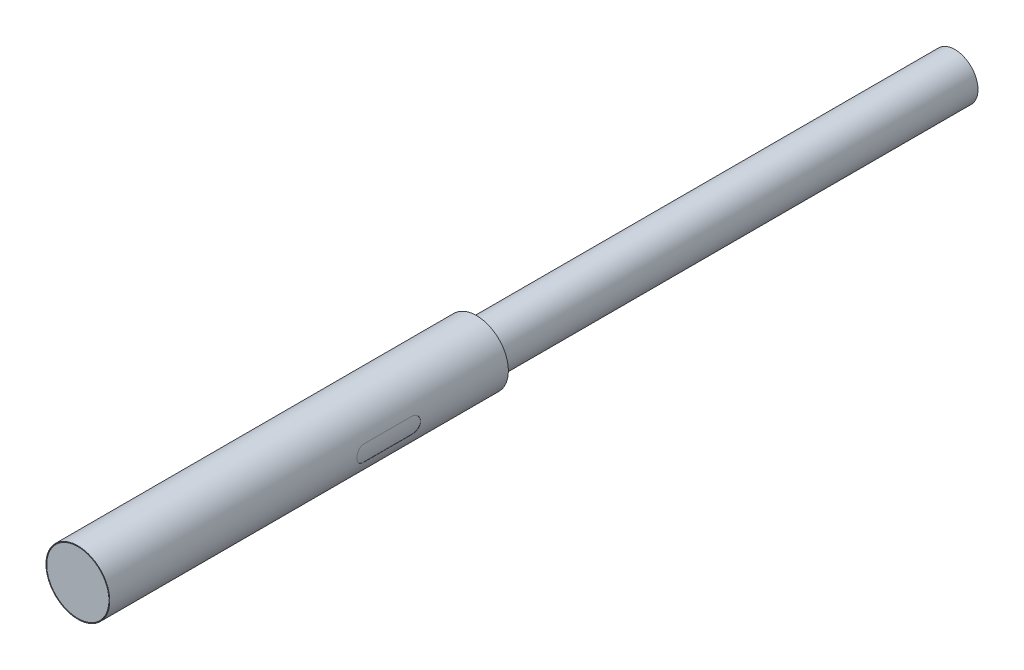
ISO-10303-21;
HEADER;
FILE_DESCRIPTION(('STEP AP214'),'2;1');
FILE_NAME('part.step','',(''),(''),'','','');
FILE_SCHEMA(('AUTOMOTIVE_DESIGN { 1 0 10303 214 1 1 1 1 }'));
ENDSEC;
DATA;
#1=APPLICATION_CONTEXT('core data for automotive mechanical design processes');
#2=APPLICATION_PROTOCOL_DEFINITION('international standard','automotive_design',2000,#1);
#3=PRODUCT_CONTEXT('',#1,'mechanical');
#4=PRODUCT('Part','Part','',(#3));
#5=PRODUCT_RELATED_PRODUCT_CATEGORY('part','',(#4));
#6=PRODUCT_DEFINITION_FORMATION('','',#4);
#7=PRODUCT_DEFINITION_CONTEXT('part definition',#1,'design');
#8=PRODUCT_DEFINITION('design','',#6,#7);
#9=PRODUCT_DEFINITION_SHAPE('','',#8);
#10=(LENGTH_UNIT() NAMED_UNIT(*) SI_UNIT(.MILLI.,.METRE.));
#11=(NAMED_UNIT(*) PLANE_ANGLE_UNIT() SI_UNIT($,.RADIAN.));
#12=(NAMED_UNIT(*) SI_UNIT($,.STERADIAN.) SOLID_ANGLE_UNIT());
#13=UNCERTAINTY_MEASURE_WITH_UNIT(LENGTH_MEASURE(1.E-05),#10,'distance_accuracy_value','');
#14=(GEOMETRIC_REPRESENTATION_CONTEXT(3) GLOBAL_UNCERTAINTY_ASSIGNED_CONTEXT((#13)) GLOBAL_UNIT_ASSIGNED_CONTEXT((#10,
#11,#12)) REPRESENTATION_CONTEXT('',''));
#15=CARTESIAN_POINT('',(0.,0.,0.));
#16=DIRECTION('',(0.,0.,1.));
#17=DIRECTION('',(1.,0.,0.));
#18=AXIS2_PLACEMENT_3D('',#15,#16,#17);
#19=CARTESIAN_POINT('',(0.,0.,-25.));
#20=DIRECTION('',(0.,0.,1.));
#21=DIRECTION('',(1.,0.,0.));
#22=AXIS2_PLACEMENT_3D('',#19,#20,#21);
#23=CYLINDRICAL_SURFACE('',#22,2.);
#24=CARTESIAN_POINT('',(1.93782484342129,-0.494807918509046,-19.));
#25=CARTESIAN_POINT('',(1.93801507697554,-0.494062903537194,-19.1331739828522));
#26=CARTESIAN_POINT('',(1.952351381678,-0.443966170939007,-19.2598228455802));
#27=CARTESIAN_POINT('',(1.97707122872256,-0.305589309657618,-19.4004185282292));
#28=CARTESIAN_POINT('',(1.98500413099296,-0.252009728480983,-19.4365662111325));
#29=CARTESIAN_POINT('',(1.99670398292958,-0.130090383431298,-19.4873132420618));
#30=CARTESIAN_POINT('',(2.,-0.0662868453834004,-19.4999999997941));
#31=CARTESIAN_POINT('',(2.,0.0662868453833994,-19.4999999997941));
#32=CARTESIAN_POINT('',(1.99670293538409,0.130101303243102,-19.4872943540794));
#33=CARTESIAN_POINT('',(1.98500517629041,0.251998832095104,-19.436585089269));
#34=CARTESIAN_POINT('',(1.9770728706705,0.30558011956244,-19.4004091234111));
#35=CARTESIAN_POINT('',(1.96058968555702,0.397849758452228,-19.3066974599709));
#36=CARTESIAN_POINT('',(1.95268375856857,0.433205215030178,-19.252429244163));
#37=CARTESIAN_POINT('',(1.94109552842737,0.482481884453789,-19.1302540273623));
#38=CARTESIAN_POINT('',(1.93784043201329,0.494746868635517,-19.0664734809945));
#39=CARTESIAN_POINT('',(1.93782484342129,0.494807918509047,-19.));
#40=B_SPLINE_CURVE_WITH_KNOTS('',3,(#24,#25,#26,#27,#28,#29,#30,#31,#32,#33,#34,#35,#36,#37,#38,
#39),.UNSPECIFIED.,.F.,.F.,(4,2,2,2,2,2,2,4),(0.,0.25,0.375,0.5,0.625,0.75,0.875,1.),.UNSPECIFIED.);
#41=CARTESIAN_POINT('',(1.93782484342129,-0.494807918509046,-19.));
#42=VERTEX_POINT('',#41);
#43=CARTESIAN_POINT('',(1.93782484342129,0.494807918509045,-19.));
#44=VERTEX_POINT('',#43);
#45=EDGE_CURVE('E122',#42,#44,#40,.T.);
#46=ORIENTED_EDGE('',*,*,#45,.F.);
#47=DIRECTION('',(0.,0.,-1.));
#48=VECTOR('',#47,1.);
#49=CARTESIAN_POINT('',(1.93782484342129,-0.494807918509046,-16.));
#50=LINE('',#49,#48);
#51=CARTESIAN_POINT('',(1.93782484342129,-0.494807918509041,-16.));
#52=VERTEX_POINT('',#51);
#53=EDGE_CURVE('E128',#52,#42,#50,.T.);
#54=ORIENTED_EDGE('',*,*,#53,.F.);
#55=CARTESIAN_POINT('',(1.93782484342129,0.494807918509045,-16.));
#56=CARTESIAN_POINT('',(1.93801507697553,0.494062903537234,-15.8668260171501));
#57=CARTESIAN_POINT('',(1.95235138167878,0.443966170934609,-15.740177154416));
#58=CARTESIAN_POINT('',(1.97707122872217,0.305589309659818,-15.5995814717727));
#59=CARTESIAN_POINT('',(1.98500413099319,0.252009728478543,-15.5634337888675));
#60=CARTESIAN_POINT('',(1.99670398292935,0.13009038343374,-15.5126867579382));
#61=CARTESIAN_POINT('',(2.,0.0662868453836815,-15.5000000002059));
#62=CARTESIAN_POINT('',(2.,-0.0662868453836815,-15.5000000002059));
#63=CARTESIAN_POINT('',(1.99670293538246,-0.130101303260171,-15.5127056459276));
#64=CARTESIAN_POINT('',(1.98500517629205,-0.251998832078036,-15.563414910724));
#65=CARTESIAN_POINT('',(1.97707287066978,-0.305580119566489,-15.5995908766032));
#66=CARTESIAN_POINT('',(1.96058968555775,-0.39784975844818,-15.6933025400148));
#67=CARTESIAN_POINT('',(1.95268375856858,-0.433205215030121,-15.7475707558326));
#68=CARTESIAN_POINT('',(1.94109552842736,-0.48248188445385,-15.8697459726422));
#69=CARTESIAN_POINT('',(1.93784043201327,-0.494746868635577,-15.93352651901));
#70=CARTESIAN_POINT('',(1.93782484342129,-0.494807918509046,-16.));
#71=B_SPLINE_CURVE_WITH_KNOTS('',3,(#55,#56,#57,#58,#59,#60,#61,#62,#63,#64,#65,#66,#67,#68,#69,
#70),.UNSPECIFIED.,.F.,.F.,(4,2,2,2,2,2,2,4),(0.,0.25,0.375,0.5,0.625,0.75,0.875,1.),.UNSPECIFIED.);
#72=CARTESIAN_POINT('',(1.93782484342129,0.494807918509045,-16.));
#73=VERTEX_POINT('',#72);
#74=EDGE_CURVE('E76',#73,#52,#71,.T.);
#75=ORIENTED_EDGE('',*,*,#74,.F.);
#76=DIRECTION('',(0.,0.,1.));
#77=VECTOR('',#76,1.);
#78=CARTESIAN_POINT('',(1.93782484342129,0.494807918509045,-19.));
#79=LINE('',#78,#77);
#80=EDGE_CURVE('E113',#44,#73,#79,.T.);
#81=ORIENTED_EDGE('',*,*,#80,.F.);
#82=EDGE_LOOP('',(#46,#54,#75,#81));
#83=FACE_BOUND('',#82,.T.);
#84=CARTESIAN_POINT('',(0.,0.,-25.));
#85=DIRECTION('',(0.,0.,1.));
#86=DIRECTION('',(1.,0.,0.));
#87=AXIS2_PLACEMENT_3D('',#84,#85,#86);
#88=CIRCLE('',#87,2.);
#89=CARTESIAN_POINT('',(2.,0.,-25.));
#90=VERTEX_POINT('',#89);
#91=EDGE_CURVE('E68',#90,#90,#88,.T.);
#92=ORIENTED_EDGE('',*,*,#91,.T.);
#93=EDGE_LOOP('',(#92));
#94=FACE_BOUND('',#93,.T.);
#95=CARTESIAN_POINT('',(0.,0.,0.));
#96=DIRECTION('',(0.,0.,1.));
#97=DIRECTION('',(1.,0.,0.));
#98=AXIS2_PLACEMENT_3D('',#95,#96,#97);
#99=CIRCLE('',#98,2.);
#100=CARTESIAN_POINT('',(2.,0.,0.));
#101=VERTEX_POINT('',#100);
#102=EDGE_CURVE('E337',#101,#101,#99,.T.);
#103=ORIENTED_EDGE('',*,*,#102,.F.);
#104=EDGE_LOOP('',(#103));
#105=FACE_BOUND('',#104,.T.);
#106=ADVANCED_FACE('F58',(#83,#94,#105),#23,.T.);
#107=CARTESIAN_POINT('',(0.,0.,-25.));
#108=DIRECTION('',(0.,0.,1.));
#109=DIRECTION('',(1.,0.,0.));
#110=AXIS2_PLACEMENT_3D('',#107,#108,#109);
#111=PLANE('',#110);
#112=CARTESIAN_POINT('',(0.,0.,-25.));
#113=DIRECTION('',(0.,0.,1.));
#114=DIRECTION('',(1.,0.,0.));
#115=AXIS2_PLACEMENT_3D('',#112,#113,#114);
#116=CIRCLE('',#115,1.45);
#117=CARTESIAN_POINT('',(1.45,0.,-25.));
#118=VERTEX_POINT('',#117);
#119=EDGE_CURVE('E13',#118,#118,#116,.F.);
#120=ORIENTED_EDGE('',*,*,#119,.F.);
#121=EDGE_LOOP('',(#120));
#122=FACE_BOUND('',#121,.T.);
#123=ORIENTED_EDGE('',*,*,#91,.F.);
#124=EDGE_LOOP('',(#123));
#125=FACE_BOUND('',#124,.T.);
#126=ADVANCED_FACE('F286',(#122,#125),#111,.F.);
#127=CARTESIAN_POINT('',(0.,0.,0.));
#128=DIRECTION('',(0.,0.,1.));
#129=DIRECTION('',(1.,0.,0.));
#130=AXIS2_PLACEMENT_3D('',#127,#128,#129);
#131=PLANE('',#130);
#132=CARTESIAN_POINT('',(0.,0.,0.));
#133=DIRECTION('',(0.,0.,1.));
#134=DIRECTION('',(1.,0.,0.));
#135=AXIS2_PLACEMENT_3D('',#132,#133,#134);
#136=CIRCLE('',#135,1.975);
#137=CARTESIAN_POINT('',(1.975,0.,0.));
#138=VERTEX_POINT('',#137);
#139=EDGE_CURVE('E332',#138,#138,#136,.T.);
#140=ORIENTED_EDGE('',*,*,#139,.F.);
#141=EDGE_LOOP('',(#140));
#142=FACE_BOUND('',#141,.T.);
#143=ORIENTED_EDGE('',*,*,#102,.T.);
#144=EDGE_LOOP('',(#143));
#145=FACE_BOUND('',#144,.T.);
#146=ADVANCED_FACE('F290',(#142,#145),#131,.T.);
#147=CARTESIAN_POINT('',(0.,0.,-0.1));
#148=DIRECTION('',(0.,0.,1.));
#149=DIRECTION('',(1.,0.,0.));
#150=AXIS2_PLACEMENT_3D('',#147,#148,#149);
#151=CYLINDRICAL_SURFACE('',#150,1.975);
#152=CARTESIAN_POINT('',(0.,0.,-0.1));
#153=DIRECTION('',(0.,0.,1.));
#154=DIRECTION('',(1.,0.,0.));
#155=AXIS2_PLACEMENT_3D('',#152,#153,#154);
#156=CIRCLE('',#155,1.975);
#157=CARTESIAN_POINT('',(1.975,0.,-0.1));
#158=VERTEX_POINT('',#157);
#159=EDGE_CURVE('E334',#158,#158,#156,.T.);
#160=ORIENTED_EDGE('',*,*,#159,.F.);
#161=EDGE_LOOP('',(#160));
#162=FACE_BOUND('',#161,.T.);
#163=ORIENTED_EDGE('',*,*,#139,.T.);
#164=EDGE_LOOP('',(#163));
#165=FACE_BOUND('',#164,.T.);
#166=ADVANCED_FACE('F296',(#162,#165),#151,.F.);
#167=CARTESIAN_POINT('',(0.,0.,-0.1));
#168=DIRECTION('',(0.,0.,1.));
#169=DIRECTION('',(1.,0.,0.));
#170=AXIS2_PLACEMENT_3D('',#167,#168,#169);
#171=PLANE('',#170);
#172=CARTESIAN_POINT('',(0.,0.,-0.1));
#173=DIRECTION('',(0.,0.,1.));
#174=DIRECTION('',(1.,0.,0.));
#175=AXIS2_PLACEMENT_3D('',#172,#173,#174);
#176=CIRCLE('',#175,1.95);
#177=CARTESIAN_POINT('',(1.95,0.,-0.1));
#178=VERTEX_POINT('',#177);
#179=EDGE_CURVE('E325',#178,#178,#176,.T.);
#180=ORIENTED_EDGE('',*,*,#179,.F.);
#181=EDGE_LOOP('',(#180));
#182=FACE_BOUND('',#181,.T.);
#183=ORIENTED_EDGE('',*,*,#159,.T.);
#184=EDGE_LOOP('',(#183));
#185=FACE_BOUND('',#184,.T.);
#186=ADVANCED_FACE('F304',(#182,#185),#171,.T.);
#187=CARTESIAN_POINT('',(0.,0.,-0.1));
#188=DIRECTION('',(0.,0.,1.));
#189=DIRECTION('',(1.,0.,0.));
#190=AXIS2_PLACEMENT_3D('',#187,#188,#189);
#191=CYLINDRICAL_SURFACE('',#190,1.95);
#192=ORIENTED_EDGE('',*,*,#179,.T.);
#193=EDGE_LOOP('',(#192));
#194=FACE_BOUND('',#193,.T.);
#195=CARTESIAN_POINT('',(0.,0.,0.));
#196=DIRECTION('',(0.,0.,1.));
#197=DIRECTION('',(1.,0.,0.));
#198=AXIS2_PLACEMENT_3D('',#195,#196,#197);
#199=CIRCLE('',#198,1.95);
#200=CARTESIAN_POINT('',(1.95,0.,0.));
#201=VERTEX_POINT('',#200);
#202=EDGE_CURVE('E322',#201,#201,#199,.T.);
#203=ORIENTED_EDGE('',*,*,#202,.F.);
#204=EDGE_LOOP('',(#203));
#205=FACE_BOUND('',#204,.T.);
#206=ADVANCED_FACE('F308',(#194,#205),#191,.T.);
#207=ORIENTED_EDGE('',*,*,#202,.T.);
#208=EDGE_LOOP('',(#207));
#209=FACE_BOUND('',#208,.T.);
#210=ADVANCED_FACE('F298',(#209),#131,.T.);
#211=CARTESIAN_POINT('',(0.,0.,-55.));
#212=DIRECTION('',(0.,0.,1.));
#213=DIRECTION('',(1.,0.,0.));
#214=AXIS2_PLACEMENT_3D('',#211,#212,#213);
#215=CYLINDRICAL_SURFACE('',#214,1.45);
#216=CARTESIAN_POINT('',(0.,0.,-55.));
#217=DIRECTION('',(0.,0.,-1.));
#218=DIRECTION('',(-1.,0.,0.));
#219=AXIS2_PLACEMENT_3D('',#216,#217,#218);
#220=CIRCLE('',#219,1.45);
#221=CARTESIAN_POINT('',(-1.45,0.,-55.));
#222=VERTEX_POINT('',#221);
#223=EDGE_CURVE('E223',#222,#222,#220,.T.);
#224=ORIENTED_EDGE('',*,*,#223,.F.);
#225=EDGE_LOOP('',(#224));
#226=FACE_BOUND('',#225,.T.);
#227=ORIENTED_EDGE('',*,*,#119,.T.);
#228=EDGE_LOOP('',(#227));
#229=FACE_BOUND('',#228,.T.);
#230=ADVANCED_FACE('F313',(#226,#229),#215,.T.);
#231=CARTESIAN_POINT('',(0.,0.,-55.));
#232=DIRECTION('',(0.,0.,-1.));
#233=DIRECTION('',(-1.,0.,0.));
#234=AXIS2_PLACEMENT_3D('',#231,#232,#233);
#235=PLANE('',#234);
#236=ORIENTED_EDGE('',*,*,#223,.T.);
#237=EDGE_LOOP('',(#236));
#238=FACE_BOUND('',#237,.T.);
#239=ADVANCED_FACE('F244',(#238),#235,.T.);
#240=CARTESIAN_POINT('',(1.93782484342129,-0.494807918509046,-19.));
#241=CARTESIAN_POINT('',(1.93801507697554,-0.494062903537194,-19.1331739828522));
#242=CARTESIAN_POINT('',(1.952351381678,-0.443966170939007,-19.2598228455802));
#243=CARTESIAN_POINT('',(1.97707122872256,-0.305589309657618,-19.4004185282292));
#244=CARTESIAN_POINT('',(1.98500413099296,-0.252009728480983,-19.4365662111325));
#245=CARTESIAN_POINT('',(1.99670398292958,-0.130090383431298,-19.4873132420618));
#246=CARTESIAN_POINT('',(2.,-0.0662868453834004,-19.4999999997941));
#247=CARTESIAN_POINT('',(2.,0.0662868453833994,-19.4999999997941));
#248=CARTESIAN_POINT('',(1.99670293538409,0.130101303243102,-19.4872943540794));
#249=CARTESIAN_POINT('',(1.98500517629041,0.251998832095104,-19.436585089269));
#250=CARTESIAN_POINT('',(1.9770728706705,0.30558011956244,-19.4004091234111));
#251=CARTESIAN_POINT('',(1.96058968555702,0.397849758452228,-19.3066974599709));
#252=CARTESIAN_POINT('',(1.95268375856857,0.433205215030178,-19.252429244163));
#253=CARTESIAN_POINT('',(1.94109552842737,0.482481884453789,-19.1302540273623));
#254=CARTESIAN_POINT('',(1.93784043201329,0.494746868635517,-19.0664734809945));
#255=CARTESIAN_POINT('',(1.93782484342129,0.494807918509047,-19.));
#256=CARTESIAN_POINT('',(1.92813571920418,-0.492333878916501,-19.));
#257=CARTESIAN_POINT('',(1.92832500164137,-0.491592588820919,-19.1331740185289));
#258=CARTESIAN_POINT('',(1.94258962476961,-0.441746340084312,-19.2598228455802));
#259=CARTESIAN_POINT('',(1.96718587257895,-0.30406136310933,-19.4004185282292));
#260=CARTESIAN_POINT('',(1.97507911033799,-0.250749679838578,-19.4365662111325));
#261=CARTESIAN_POINT('',(1.98672046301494,-0.129439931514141,-19.4873132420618));
#262=CARTESIAN_POINT('',(1.99,-0.0659554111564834,-19.4999999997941));
#263=CARTESIAN_POINT('',(1.99,0.0659554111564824,-19.4999999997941));
#264=CARTESIAN_POINT('',(1.98671942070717,0.129450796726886,-19.4872943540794));
#265=CARTESIAN_POINT('',(1.97508015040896,0.250738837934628,-19.436585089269));
#266=CARTESIAN_POINT('',(1.96718750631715,0.304052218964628,-19.4004091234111));
#267=CARTESIAN_POINT('',(1.95078673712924,0.395860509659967,-19.3066974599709));
#268=CARTESIAN_POINT('',(1.94292033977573,0.431039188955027,-19.252429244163));
#269=CARTESIAN_POINT('',(1.93139005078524,0.48006947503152,-19.1302540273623));
#270=CARTESIAN_POINT('',(1.92815122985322,0.492273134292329,-19.0664734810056));
#271=CARTESIAN_POINT('',(1.92813571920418,0.492333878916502,-19.));
#272=B_SPLINE_SURFACE_WITH_KNOTS('',1,3,((#240,#241,#242,#243,#244,#245,#246,#247,#248,#249,
#250,#251,#252,#253,#254,#255),(#256,#257,#258,#259,#260,#261,#262,#263,#264,#265,#266,#267,
#268,#269,#270,#271)),.UNSPECIFIED.,.F.,.F.,.F.,(2,2),(4,2,2,2,2,2,2,4),(0.,1.),(0.,0.25,0.375,
0.5,0.625,0.75,0.875,1.),.UNSPECIFIED.);
#273=CARTESIAN_POINT('',(1.92813571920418,-0.492333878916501,-19.));
#274=CARTESIAN_POINT('',(1.93782484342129,-0.494807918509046,-19.));
#275=B_SPLINE_CURVE_WITH_KNOTS('',1,(#273,#274),.UNSPECIFIED.,.F.,.F.,(2,2),(0.,1.),.UNSPECIFIED.);
#276=CARTESIAN_POINT('',(1.92813571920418,-0.492333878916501,-19.));
#277=VERTEX_POINT('',#276);
#278=EDGE_CURVE('E86',#277,#42,#275,.T.);
#279=CARTESIAN_POINT('',(1.93782484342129,0.494807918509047,-19.));
#280=CARTESIAN_POINT('',(1.92813571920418,0.492333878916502,-19.));
#281=B_SPLINE_CURVE_WITH_KNOTS('',1,(#279,#280),.UNSPECIFIED.,.F.,.F.,(2,2),(0.,1.),.UNSPECIFIED.);
#282=CARTESIAN_POINT('',(1.92813571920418,0.4923338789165,-19.));
#283=VERTEX_POINT('',#282);
#284=EDGE_CURVE('E109',#283,#44,#281,.F.);
#285=CARTESIAN_POINT('',(1.92813571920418,0.492333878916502,-19.));
#286=CARTESIAN_POINT('',(1.92815122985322,0.492273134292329,-19.0664734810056));
#287=CARTESIAN_POINT('',(1.93139005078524,0.48006947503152,-19.1302540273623));
#288=CARTESIAN_POINT('',(1.94292033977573,0.431039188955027,-19.252429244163));
#289=CARTESIAN_POINT('',(1.95078673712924,0.395860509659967,-19.3066974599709));
#290=CARTESIAN_POINT('',(1.96718750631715,0.304052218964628,-19.4004091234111));
#291=CARTESIAN_POINT('',(1.97508015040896,0.250738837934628,-19.436585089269));
#292=CARTESIAN_POINT('',(1.98671942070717,0.129450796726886,-19.4872943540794));
#293=CARTESIAN_POINT('',(1.99,0.0659554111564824,-19.4999999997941));
#294=CARTESIAN_POINT('',(1.99,-0.0659554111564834,-19.4999999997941));
#295=CARTESIAN_POINT('',(1.98672046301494,-0.129439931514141,-19.4873132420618));
#296=CARTESIAN_POINT('',(1.97507911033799,-0.250749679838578,-19.4365662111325));
#297=CARTESIAN_POINT('',(1.96718587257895,-0.30406136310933,-19.4004185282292));
#298=CARTESIAN_POINT('',(1.94258962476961,-0.441746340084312,-19.2598228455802));
#299=CARTESIAN_POINT('',(1.92832500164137,-0.491592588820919,-19.1331740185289));
#300=CARTESIAN_POINT('',(1.92813571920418,-0.492333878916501,-19.));
#301=B_SPLINE_CURVE_WITH_KNOTS('',3,(#285,#286,#287,#288,#289,#290,#291,#292,#293,#294,#295,
#296,#297,#298,#299,#300),.UNSPECIFIED.,.F.,.F.,(4,2,2,2,2,2,2,4),(0.,0.125,0.25,0.375,0.5,
0.625,0.75,1.),.UNSPECIFIED.);
#302=EDGE_CURVE('E179',#277,#283,#301,.F.);
#303=ORIENTED_EDGE('',*,*,#278,.T.);
#304=ORIENTED_EDGE('',*,*,#45,.T.);
#305=ORIENTED_EDGE('',*,*,#284,.F.);
#306=ORIENTED_EDGE('',*,*,#302,.F.);
#307=EDGE_LOOP('',(#303,#304,#305,#306));
#308=FACE_BOUND('',#307,.T.);
#309=ADVANCED_FACE('F124',(#308),#272,.F.);
#310=CARTESIAN_POINT('',(1.93782484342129,0.494807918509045,-17.5));
#311=DIRECTION('',(-0.247403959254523,0.968912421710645,0.));
#312=DIRECTION('',(0.,0.,1.));
#313=AXIS2_PLACEMENT_3D('',#310,#311,#312);
#314=PLANE('',#313);
#315=ORIENTED_EDGE('',*,*,#284,.T.);
#316=ORIENTED_EDGE('',*,*,#80,.T.);
#317=CARTESIAN_POINT('',(1.92813571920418,0.4923338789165,-16.));
#318=CARTESIAN_POINT('',(1.93782484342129,0.494807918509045,-16.));
#319=B_SPLINE_CURVE_WITH_KNOTS('',1,(#317,#318),.UNSPECIFIED.,.F.,.F.,(2,2),(0.,1.),.UNSPECIFIED.);
#320=CARTESIAN_POINT('',(1.92813571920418,0.4923338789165,-16.));
#321=VERTEX_POINT('',#320);
#322=EDGE_CURVE('E118',#321,#73,#319,.T.);
#323=ORIENTED_EDGE('',*,*,#322,.F.);
#324=DIRECTION('',(0.,0.,1.));
#325=VECTOR('',#324,1.);
#326=CARTESIAN_POINT('',(1.92813571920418,0.4923338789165,-25.));
#327=LINE('',#326,#325);
#328=EDGE_CURVE('E115',#283,#321,#327,.T.);
#329=ORIENTED_EDGE('',*,*,#328,.F.);
#330=EDGE_LOOP('',(#315,#316,#323,#329));
#331=FACE_BOUND('',#330,.T.);
#332=ADVANCED_FACE('F111',(#331),#314,.F.);
#333=CARTESIAN_POINT('',(1.93782484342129,0.494807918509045,-16.));
#334=CARTESIAN_POINT('',(1.93801507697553,0.494062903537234,-15.8668260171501));
#335=CARTESIAN_POINT('',(1.95235138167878,0.443966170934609,-15.740177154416));
#336=CARTESIAN_POINT('',(1.97707122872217,0.305589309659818,-15.5995814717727));
#337=CARTESIAN_POINT('',(1.98500413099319,0.252009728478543,-15.5634337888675));
#338=CARTESIAN_POINT('',(1.99670398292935,0.13009038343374,-15.5126867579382));
#339=CARTESIAN_POINT('',(2.,0.0662868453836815,-15.5000000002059));
#340=CARTESIAN_POINT('',(2.,-0.0662868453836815,-15.5000000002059));
#341=CARTESIAN_POINT('',(1.99670293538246,-0.130101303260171,-15.5127056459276));
#342=CARTESIAN_POINT('',(1.98500517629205,-0.251998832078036,-15.563414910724));
#343=CARTESIAN_POINT('',(1.97707287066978,-0.305580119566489,-15.5995908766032));
#344=CARTESIAN_POINT('',(1.96058968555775,-0.39784975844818,-15.6933025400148));
#345=CARTESIAN_POINT('',(1.95268375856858,-0.433205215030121,-15.7475707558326));
#346=CARTESIAN_POINT('',(1.94109552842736,-0.48248188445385,-15.8697459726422));
#347=CARTESIAN_POINT('',(1.93784043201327,-0.494746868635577,-15.93352651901));
#348=CARTESIAN_POINT('',(1.93782484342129,-0.494807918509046,-16.));
#349=CARTESIAN_POINT('',(1.92813571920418,0.4923338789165,-16.));
#350=CARTESIAN_POINT('',(1.92832500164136,0.491592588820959,-15.8668259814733));
#351=CARTESIAN_POINT('',(1.94258962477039,0.441746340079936,-15.740177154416));
#352=CARTESIAN_POINT('',(1.96718587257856,0.304061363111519,-15.5995814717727));
#353=CARTESIAN_POINT('',(1.97507911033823,0.25074967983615,-15.5634337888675));
#354=CARTESIAN_POINT('',(1.9867204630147,0.129439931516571,-15.5126867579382));
#355=CARTESIAN_POINT('',(1.99,0.0659554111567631,-15.5000000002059));
#356=CARTESIAN_POINT('',(1.99,-0.0659554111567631,-15.5000000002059));
#357=CARTESIAN_POINT('',(1.98671942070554,-0.12945079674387,-15.5127056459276));
#358=CARTESIAN_POINT('',(1.97508015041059,-0.250738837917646,-15.563414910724));
#359=CARTESIAN_POINT('',(1.96718750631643,-0.304052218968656,-15.5995908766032));
#360=CARTESIAN_POINT('',(1.95078673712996,-0.395860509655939,-15.6933025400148));
#361=CARTESIAN_POINT('',(1.94292033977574,-0.43103918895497,-15.7475707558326));
#362=CARTESIAN_POINT('',(1.93139005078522,-0.480069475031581,-15.8697459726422));
#363=CARTESIAN_POINT('',(1.92815122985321,-0.492273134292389,-15.9335265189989));
#364=CARTESIAN_POINT('',(1.92813571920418,-0.492333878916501,-16.));
#365=B_SPLINE_SURFACE_WITH_KNOTS('',1,3,((#333,#334,#335,#336,#337,#338,#339,#340,#341,#342,
#343,#344,#345,#346,#347,#348),(#349,#350,#351,#352,#353,#354,#355,#356,#357,#358,#359,#360,
#361,#362,#363,#364)),.UNSPECIFIED.,.F.,.F.,.F.,(2,2),(4,2,2,2,2,2,2,4),(0.,1.),(0.,0.25,0.375,
0.5,0.625,0.75,0.875,1.),.UNSPECIFIED.);
#366=CARTESIAN_POINT('',(1.93782484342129,-0.494807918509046,-16.));
#367=CARTESIAN_POINT('',(1.92813571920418,-0.492333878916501,-16.));
#368=B_SPLINE_CURVE_WITH_KNOTS('',1,(#366,#367),.UNSPECIFIED.,.F.,.F.,(2,2),(0.,1.),.UNSPECIFIED.);
#369=CARTESIAN_POINT('',(1.92813571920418,-0.492333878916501,-16.));
#370=VERTEX_POINT('',#369);
#371=EDGE_CURVE('E102',#370,#52,#368,.F.);
#372=CARTESIAN_POINT('',(1.92813571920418,-0.492333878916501,-16.));
#373=CARTESIAN_POINT('',(1.92815122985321,-0.492273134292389,-15.9335265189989));
#374=CARTESIAN_POINT('',(1.93139005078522,-0.480069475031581,-15.8697459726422));
#375=CARTESIAN_POINT('',(1.94292033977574,-0.43103918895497,-15.7475707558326));
#376=CARTESIAN_POINT('',(1.95078673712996,-0.395860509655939,-15.6933025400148));
#377=CARTESIAN_POINT('',(1.96718750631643,-0.304052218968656,-15.5995908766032));
#378=CARTESIAN_POINT('',(1.97508015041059,-0.250738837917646,-15.563414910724));
#379=CARTESIAN_POINT('',(1.98671942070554,-0.12945079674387,-15.5127056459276));
#380=CARTESIAN_POINT('',(1.99,-0.0659554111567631,-15.5000000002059));
#381=CARTESIAN_POINT('',(1.99,0.0659554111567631,-15.5000000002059));
#382=CARTESIAN_POINT('',(1.9867204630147,0.129439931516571,-15.5126867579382));
#383=CARTESIAN_POINT('',(1.97507911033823,0.25074967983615,-15.5634337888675));
#384=CARTESIAN_POINT('',(1.96718587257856,0.304061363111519,-15.5995814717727));
#385=CARTESIAN_POINT('',(1.94258962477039,0.441746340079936,-15.740177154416));
#386=CARTESIAN_POINT('',(1.92832500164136,0.491592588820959,-15.8668259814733));
#387=CARTESIAN_POINT('',(1.92813571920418,0.4923338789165,-16.));
#388=B_SPLINE_CURVE_WITH_KNOTS('',3,(#372,#373,#374,#375,#376,#377,#378,#379,#380,#381,#382,
#383,#384,#385,#386,#387),.UNSPECIFIED.,.F.,.F.,(4,2,2,2,2,2,2,4),(0.,0.125,0.25,0.375,0.5,
0.625,0.75,1.),.UNSPECIFIED.);
#389=EDGE_CURVE('E148',#321,#370,#388,.F.);
#390=ORIENTED_EDGE('',*,*,#322,.T.);
#391=ORIENTED_EDGE('',*,*,#74,.T.);
#392=ORIENTED_EDGE('',*,*,#371,.F.);
#393=ORIENTED_EDGE('',*,*,#389,.F.);
#394=EDGE_LOOP('',(#390,#391,#392,#393));
#395=FACE_BOUND('',#394,.T.);
#396=ADVANCED_FACE('F164',(#395),#365,.F.);
#397=CARTESIAN_POINT('',(1.93782484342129,-0.494807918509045,-17.5));
#398=DIRECTION('',(-0.247403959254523,-0.968912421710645,0.));
#399=DIRECTION('',(0.,0.,-1.));
#400=AXIS2_PLACEMENT_3D('',#397,#398,#399);
#401=PLANE('',#400);
#402=DIRECTION('',(0.,0.,1.));
#403=VECTOR('',#402,1.);
#404=CARTESIAN_POINT('',(1.92813571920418,-0.492333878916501,-25.));
#405=LINE('',#404,#403);
#406=EDGE_CURVE('E199',#370,#277,#405,.F.);
#407=ORIENTED_EDGE('',*,*,#406,.F.);
#408=ORIENTED_EDGE('',*,*,#371,.T.);
#409=ORIENTED_EDGE('',*,*,#53,.T.);
#410=ORIENTED_EDGE('',*,*,#278,.F.);
#411=EDGE_LOOP('',(#407,#408,#409,#410));
#412=FACE_BOUND('',#411,.T.);
#413=ADVANCED_FACE('F163',(#412),#401,.F.);
#414=CARTESIAN_POINT('',(0.,0.,-25.));
#415=DIRECTION('',(0.,0.,1.));
#416=DIRECTION('',(1.,0.,0.));
#417=AXIS2_PLACEMENT_3D('',#414,#415,#416);
#418=CYLINDRICAL_SURFACE('',#417,1.99);
#419=ORIENTED_EDGE('',*,*,#389,.T.);
#420=ORIENTED_EDGE('',*,*,#406,.T.);
#421=ORIENTED_EDGE('',*,*,#302,.T.);
#422=ORIENTED_EDGE('',*,*,#328,.T.);
#423=EDGE_LOOP('',(#419,#420,#421,#422));
#424=FACE_BOUND('',#423,.T.);
#425=ADVANCED_FACE('F154',(#424),#418,.T.);
#426=CLOSED_SHELL('',(#106,#126,#146,#166,#186,#206,#210,#230,#239,#309,#332,#396,#413,#425));
#427=MANIFOLD_SOLID_BREP('B2',#426);
#428=ADVANCED_BREP_SHAPE_REPRESENTATION('',(#18,#427),#14);
#429=SHAPE_DEFINITION_REPRESENTATION(#9,#428);
ENDSEC;
END-ISO-10303-21;
